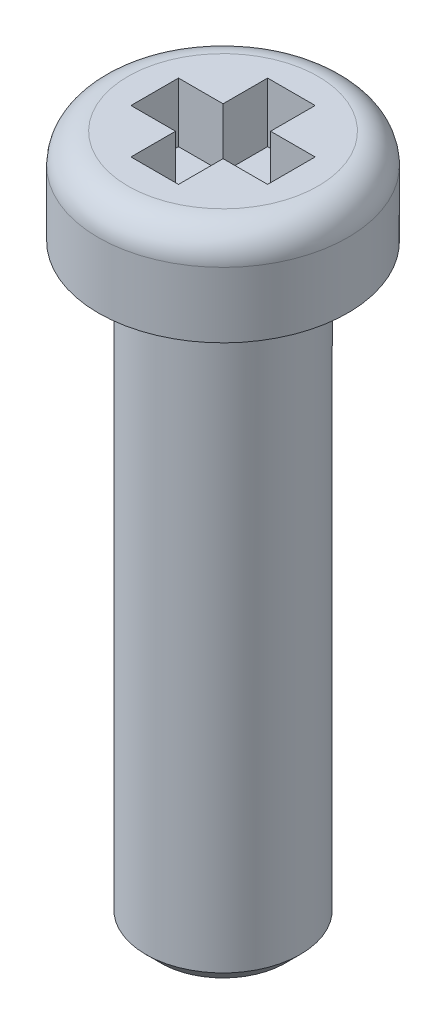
from build123d import *

# Parameters (mm, degrees)
SKETCH2_W               = 0.8
SKETCH2_H               = 2.3
CUT_EXTRUDE_THIN2_DEPTH = 1
CIRPATTERN1_COUNT       = 2
CIRPATTERN1_ANGLE       = 90
SKETCH3_R               = 1.3
BOSS_EXTRUDE1_DEPTH     = 10
FILLET1_R               = 0.2
CHAMFER1_SIZE           = 0.25


with BuildPart() as part:
    # Sketch1 → Base-Revolve (revolve)
    with BuildSketch(Plane.XY, mode=Mode.PRIVATE) as base_revolve_sk:
        with BuildLine():
            Line((2.1, 0), (0, 0))
            Line((0, 0), (0, 1.6))
            Line((0, 1.6), (1.6, 1.6))
            ThreePointArc((1.6, 1.6), (1.953553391, 1.453553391), (2.1, 1.1))
            Line((2.1, 1.1), (2.1, 0))
        make_face()
    revolve(base_revolve_sk.sketch.rotate(Axis((0, 11.592517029, 0), (0, -1, 0)), 90), axis=Axis((0, 11.592517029, 0), (0, -1, 0)))

    # Sketch2 → Cut-Extrude-Thin2 (cut)
    with BuildSketch(Plane(origin=(0, 1.6, 0), x_dir=(-1, 0, 0), z_dir=(0, 1, 0))):
        Rectangle(SKETCH2_W, SKETCH2_H)
    cut_extrude_thin2 = extrude(amount=-CUT_EXTRUDE_THIN2_DEPTH, mode=Mode.SUBTRACT)

    # CirPattern1: Cut-Extrude-Thin2 ×2 about axis
    cirpattern1_axis = Axis((0, 0, 0), (0, 1, 0))
    for i in range(1, CIRPATTERN1_COUNT):
        add(cut_extrude_thin2.rotate(cirpattern1_axis, i * CIRPATTERN1_ANGLE / (CIRPATTERN1_COUNT - 1)), mode=Mode.SUBTRACT)

    # Sketch3 → Boss-Extrude1 (add)
    with BuildSketch(Plane.XZ):
        with Locations(Location((0, 0, 0), (0, 0, 90))):
            Circle(SKETCH3_R)
    extrude(amount=BOSS_EXTRUDE1_DEPTH)

    # Fillet1
    fillet1_edges = [part.edges().sort_by_distance(p)[0] for p in [
        (0, 0, -1.3),
    ]]
    fillet(fillet1_edges, radius=FILLET1_R)

    # Chamfer1
    chamfer1_edges = [part.edges().sort_by_distance(p)[0] for p in [
        (0, -10, -1.3),
    ]]
    chamfer(chamfer1_edges, length=CHAMFER1_SIZE)


solid = part.part
